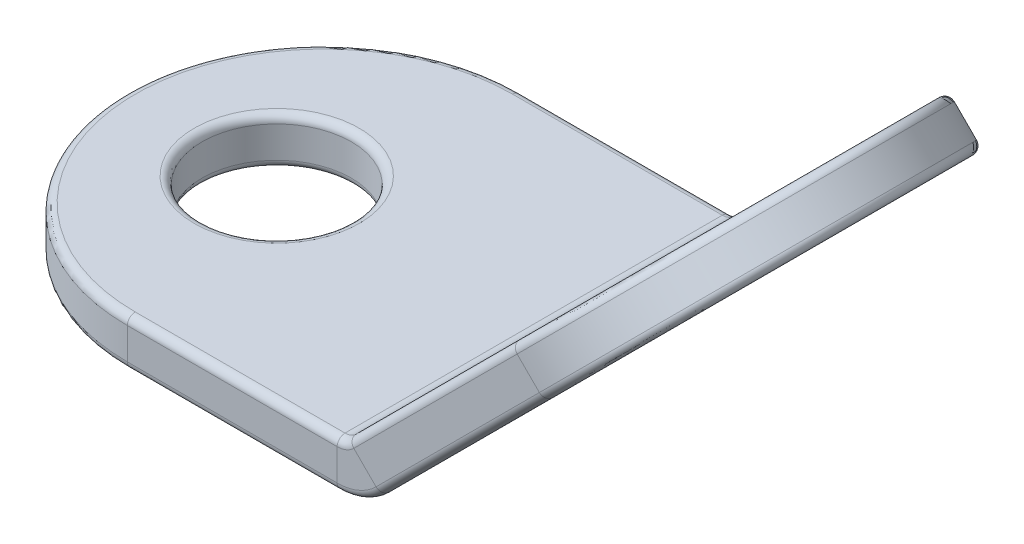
ISO-10303-21;
HEADER;
FILE_DESCRIPTION(('STEP AP214'),'2;1');
FILE_NAME('part.step','',(''),(''),'','','');
FILE_SCHEMA(('AUTOMOTIVE_DESIGN { 1 0 10303 214 1 1 1 1 }'));
ENDSEC;
DATA;
#1=APPLICATION_CONTEXT('core data for automotive mechanical design processes');
#2=APPLICATION_PROTOCOL_DEFINITION('international standard','automotive_design',2000,#1);
#3=PRODUCT_CONTEXT('',#1,'mechanical');
#4=PRODUCT('Part','Part','',(#3));
#5=PRODUCT_RELATED_PRODUCT_CATEGORY('part','',(#4));
#6=PRODUCT_DEFINITION_FORMATION('','',#4);
#7=PRODUCT_DEFINITION_CONTEXT('part definition',#1,'design');
#8=PRODUCT_DEFINITION('design','',#6,#7);
#9=PRODUCT_DEFINITION_SHAPE('','',#8);
#10=(LENGTH_UNIT() NAMED_UNIT(*) SI_UNIT(.MILLI.,.METRE.));
#11=(NAMED_UNIT(*) PLANE_ANGLE_UNIT() SI_UNIT($,.RADIAN.));
#12=(NAMED_UNIT(*) SI_UNIT($,.STERADIAN.) SOLID_ANGLE_UNIT());
#13=UNCERTAINTY_MEASURE_WITH_UNIT(LENGTH_MEASURE(1.E-05),#10,'distance_accuracy_value','');
#14=(GEOMETRIC_REPRESENTATION_CONTEXT(3) GLOBAL_UNCERTAINTY_ASSIGNED_CONTEXT((#13)) GLOBAL_UNIT_ASSIGNED_CONTEXT((#10,
#11,#12)) REPRESENTATION_CONTEXT('',''));
#15=CARTESIAN_POINT('',(0.,0.,0.));
#16=DIRECTION('',(0.,0.,1.));
#17=DIRECTION('',(1.,0.,0.));
#18=AXIS2_PLACEMENT_3D('',#15,#16,#17);
#19=CARTESIAN_POINT('',(2.71685670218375,-4.90314329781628,-6.35));
#20=DIRECTION('',(-0.707106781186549,0.707106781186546,0.));
#21=DIRECTION('',(0.,0.,1.));
#22=AXIS2_PLACEMENT_3D('',#19,#20,#21);
#23=PLANE('',#22);
#24=CARTESIAN_POINT('',(14.570794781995,6.95079478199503,-6.35));
#25=DIRECTION('',(-0.707106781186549,0.707106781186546,0.));
#26=DIRECTION('',(-0.707106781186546,-0.707106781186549,0.));
#27=AXIS2_PLACEMENT_3D('',#24,#25,#26);
#28=CIRCLE('',#27,2.667);
#29=CARTESIAN_POINT('',(14.570794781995,6.95079478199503,-3.683));
#30=VERTEX_POINT('',#29);
#31=CARTESIAN_POINT('',(14.570794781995,6.95079478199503,-9.017));
#32=VERTEX_POINT('',#31);
#33=EDGE_CURVE('E256',#30,#32,#28,.T.);
#34=ORIENTED_EDGE('',*,*,#33,.T.);
#35=DIRECTION('',(-0.707106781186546,-0.707106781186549,0.));
#36=VECTOR('',#35,1.);
#37=CARTESIAN_POINT('',(10.5296795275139,2.9096795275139,-9.017));
#38=LINE('',#37,#36);
#39=CARTESIAN_POINT('',(10.5296795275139,2.9096795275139,-9.017));
#40=VERTEX_POINT('',#39);
#41=EDGE_CURVE('E258',#32,#40,#38,.T.);
#42=ORIENTED_EDGE('',*,*,#41,.T.);
#43=CARTESIAN_POINT('',(10.5296795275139,2.9096795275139,-6.35));
#44=DIRECTION('',(-0.707106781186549,0.707106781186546,0.));
#45=DIRECTION('',(-0.707106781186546,-0.707106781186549,0.));
#46=AXIS2_PLACEMENT_3D('',#43,#44,#45);
#47=CIRCLE('',#46,2.667);
#48=CARTESIAN_POINT('',(10.5296795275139,2.9096795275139,-3.683));
#49=VERTEX_POINT('',#48);
#50=EDGE_CURVE('E252',#40,#49,#47,.T.);
#51=ORIENTED_EDGE('',*,*,#50,.T.);
#52=DIRECTION('',(0.707106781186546,0.707106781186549,0.));
#53=VECTOR('',#52,1.);
#54=CARTESIAN_POINT('',(14.570794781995,6.95079478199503,-3.683));
#55=LINE('',#54,#53);
#56=EDGE_CURVE('E254',#49,#30,#55,.T.);
#57=ORIENTED_EDGE('',*,*,#56,.T.);
#58=EDGE_LOOP('',(#34,#42,#51,#57));
#59=FACE_BOUND('',#58,.T.);
#60=DIRECTION('',(0.,0.,-1.));
#61=VECTOR('',#60,1.);
#62=CARTESIAN_POINT('',(8.21515902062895,0.595159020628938,-6.35));
#63=LINE('',#62,#61);
#64=CARTESIAN_POINT('',(8.21515902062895,0.595159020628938,-0.254));
#65=VERTEX_POINT('',#64);
#66=CARTESIAN_POINT('',(8.21515902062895,0.595159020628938,-12.446));
#67=VERTEX_POINT('',#66);
#68=EDGE_CURVE('E358',#65,#67,#63,.T.);
#69=ORIENTED_EDGE('',*,*,#68,.T.);
#70=DIRECTION('',(-0.707106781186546,-0.707106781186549,0.));
#71=VECTOR('',#70,1.);
#72=CARTESIAN_POINT('',(2.71685670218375,-4.90314329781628,-12.446));
#73=LINE('',#72,#71);
#74=CARTESIAN_POINT('',(13.4931640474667,5.87316404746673,-12.446));
#75=VERTEX_POINT('',#74);
#76=EDGE_CURVE('E265',#67,#75,#73,.F.);
#77=ORIENTED_EDGE('',*,*,#76,.T.);
#78=CARTESIAN_POINT('',(13.4931640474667,5.87316404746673,-6.35));
#79=DIRECTION('',(-0.707106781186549,0.707106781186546,0.));
#80=DIRECTION('',(-0.707106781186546,-0.707106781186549,0.));
#81=AXIS2_PLACEMENT_3D('',#78,#79,#80);
#82=CIRCLE('',#81,6.096);
#83=CARTESIAN_POINT('',(13.4931640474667,5.87316404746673,-0.254));
#84=VERTEX_POINT('',#83);
#85=EDGE_CURVE('E263',#75,#84,#82,.F.);
#86=ORIENTED_EDGE('',*,*,#85,.T.);
#87=DIRECTION('',(0.707106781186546,0.707106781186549,0.));
#88=VECTOR('',#87,1.);
#89=CARTESIAN_POINT('',(2.71685670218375,-4.90314329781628,-0.254));
#90=LINE('',#89,#88);
#91=EDGE_CURVE('E261',#84,#65,#90,.F.);
#92=ORIENTED_EDGE('',*,*,#91,.T.);
#93=EDGE_LOOP('',(#69,#77,#86,#92));
#94=FACE_BOUND('',#93,.T.);
#95=ADVANCED_FACE('F44',(#59,#94),#23,.F.);
#96=CARTESIAN_POINT('',(1.63922596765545,-3.82551256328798,0.));
#97=DIRECTION('',(0.,0.,-1.));
#98=DIRECTION('',(-0.707106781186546,-0.707106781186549,0.));
#99=AXIS2_PLACEMENT_3D('',#96,#97,#98);
#100=PLANE('',#99);
#101=DIRECTION('',(0.707106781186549,-0.707106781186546,0.));
#102=VECTOR('',#101,1.);
#103=CARTESIAN_POINT('',(7.13752828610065,1.67278975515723,0.));
#104=LINE('',#103,#102);
#105=CARTESIAN_POINT('',(7.31713340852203,1.49318463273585,0.));
#106=VERTEX_POINT('',#105);
#107=CARTESIAN_POINT('',(8.03555389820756,0.774764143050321,0.));
#108=VERTEX_POINT('',#107);
#109=EDGE_CURVE('E209',#106,#108,#104,.T.);
#110=ORIENTED_EDGE('',*,*,#109,.T.);
#111=DIRECTION('',(0.707106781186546,0.707106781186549,0.));
#112=VECTOR('',#111,1.);
#113=CARTESIAN_POINT('',(2.53725157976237,-4.72353817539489,0.));
#114=LINE('',#113,#112);
#115=CARTESIAN_POINT('',(13.3135589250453,6.05276916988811,0.));
#116=VERTEX_POINT('',#115);
#117=EDGE_CURVE('E273',#108,#116,#114,.T.);
#118=ORIENTED_EDGE('',*,*,#117,.T.);
#119=DIRECTION('',(0.707106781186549,-0.707106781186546,0.));
#120=VECTOR('',#119,1.);
#121=CARTESIAN_POINT('',(12.4155333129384,6.95079478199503,0.));
#122=LINE('',#121,#120);
#123=CARTESIAN_POINT('',(12.5951384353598,6.77118965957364,0.));
#124=VERTEX_POINT('',#123);
#125=EDGE_CURVE('E350',#124,#116,#122,.T.);
#126=ORIENTED_EDGE('',*,*,#125,.F.);
#127=DIRECTION('',(0.707106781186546,0.707106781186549,0.));
#128=VECTOR('',#127,1.);
#129=CARTESIAN_POINT('',(7.31713340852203,1.49318463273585,0.));
#130=LINE('',#129,#128);
#131=EDGE_CURVE('E271',#124,#106,#130,.F.);
#132=ORIENTED_EDGE('',*,*,#131,.T.);
#133=EDGE_LOOP('',(#110,#118,#126,#132));
#134=FACE_BOUND('',#133,.T.);
#135=ADVANCED_FACE('F46',(#134),#100,.F.);
#136=CARTESIAN_POINT('',(1.63922596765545,-3.82551256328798,-12.7));
#137=DIRECTION('',(0.,0.,1.));
#138=DIRECTION('',(0.707106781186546,0.707106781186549,0.));
#139=AXIS2_PLACEMENT_3D('',#136,#137,#138);
#140=PLANE('',#139);
#141=DIRECTION('',(0.707106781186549,-0.707106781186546,0.));
#142=VECTOR('',#141,1.);
#143=CARTESIAN_POINT('',(12.4155333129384,6.95079478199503,-12.7));
#144=LINE('',#143,#142);
#145=CARTESIAN_POINT('',(12.5951384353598,6.77118965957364,-12.7));
#146=VERTEX_POINT('',#145);
#147=CARTESIAN_POINT('',(13.3135589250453,6.05276916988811,-12.7));
#148=VERTEX_POINT('',#147);
#149=EDGE_CURVE('E347',#146,#148,#144,.T.);
#150=ORIENTED_EDGE('',*,*,#149,.T.);
#151=DIRECTION('',(-0.707106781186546,-0.707106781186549,0.));
#152=VECTOR('',#151,1.);
#153=CARTESIAN_POINT('',(2.53725157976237,-4.72353817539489,-12.7));
#154=LINE('',#153,#152);
#155=CARTESIAN_POINT('',(8.03555389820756,0.774764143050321,-12.7));
#156=VERTEX_POINT('',#155);
#157=EDGE_CURVE('E269',#148,#156,#154,.T.);
#158=ORIENTED_EDGE('',*,*,#157,.T.);
#159=DIRECTION('',(-0.707106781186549,0.707106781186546,0.));
#160=VECTOR('',#159,1.);
#161=CARTESIAN_POINT('',(7.13752828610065,1.67278975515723,-12.7));
#162=LINE('',#161,#160);
#163=CARTESIAN_POINT('',(7.31713340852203,1.49318463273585,-12.7));
#164=VERTEX_POINT('',#163);
#165=EDGE_CURVE('E355',#156,#164,#162,.T.);
#166=ORIENTED_EDGE('',*,*,#165,.T.);
#167=DIRECTION('',(-0.707106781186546,-0.707106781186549,0.));
#168=VECTOR('',#167,1.);
#169=CARTESIAN_POINT('',(12.5951384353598,6.77118965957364,-12.7));
#170=LINE('',#169,#168);
#171=EDGE_CURVE('E267',#164,#146,#170,.F.);
#172=ORIENTED_EDGE('',*,*,#171,.T.);
#173=EDGE_LOOP('',(#150,#158,#166,#172));
#174=FACE_BOUND('',#173,.T.);
#175=ADVANCED_FACE('F501',(#174),#140,.F.);
#176=CARTESIAN_POINT('',(1.63922596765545,-3.82551256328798,-6.35));
#177=DIRECTION('',(-0.707106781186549,0.707106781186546,0.));
#178=DIRECTION('',(0.,0.,1.));
#179=AXIS2_PLACEMENT_3D('',#176,#177,#178);
#180=PLANE('',#179);
#181=DIRECTION('',(-0.707106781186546,-0.707106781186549,0.));
#182=VECTOR('',#181,1.);
#183=CARTESIAN_POINT('',(1.63922596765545,-3.82551256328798,-9.017));
#184=LINE('',#183,#182);
#185=CARTESIAN_POINT('',(9.4520487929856,3.9873102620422,-9.017));
#186=VERTEX_POINT('',#185);
#187=CARTESIAN_POINT('',(13.4931640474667,8.02842551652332,-9.017));
#188=VERTEX_POINT('',#187);
#189=EDGE_CURVE('E303',#186,#188,#184,.F.);
#190=ORIENTED_EDGE('',*,*,#189,.T.);
#191=CARTESIAN_POINT('',(13.4931640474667,8.02842551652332,-6.35));
#192=DIRECTION('',(-0.707106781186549,0.707106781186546,0.));
#193=DIRECTION('',(-0.707106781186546,-0.707106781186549,0.));
#194=AXIS2_PLACEMENT_3D('',#191,#192,#193);
#195=CIRCLE('',#194,2.667);
#196=CARTESIAN_POINT('',(13.4931640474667,8.02842551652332,-3.683));
#197=VERTEX_POINT('',#196);
#198=EDGE_CURVE('E305',#188,#197,#195,.F.);
#199=ORIENTED_EDGE('',*,*,#198,.T.);
#200=DIRECTION('',(0.707106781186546,0.707106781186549,0.));
#201=VECTOR('',#200,1.);
#202=CARTESIAN_POINT('',(1.63922596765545,-3.82551256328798,-3.683));
#203=LINE('',#202,#201);
#204=CARTESIAN_POINT('',(9.4520487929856,3.9873102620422,-3.683));
#205=VERTEX_POINT('',#204);
#206=EDGE_CURVE('E299',#197,#205,#203,.F.);
#207=ORIENTED_EDGE('',*,*,#206,.T.);
#208=CARTESIAN_POINT('',(9.4520487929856,3.9873102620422,-6.35));
#209=DIRECTION('',(-0.707106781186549,0.707106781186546,0.));
#210=DIRECTION('',(-0.707106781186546,-0.707106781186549,0.));
#211=AXIS2_PLACEMENT_3D('',#208,#209,#210);
#212=CIRCLE('',#211,2.667);
#213=EDGE_CURVE('E301',#205,#186,#212,.F.);
#214=ORIENTED_EDGE('',*,*,#213,.T.);
#215=EDGE_LOOP('',(#190,#199,#207,#214));
#216=FACE_BOUND('',#215,.T.);
#217=CARTESIAN_POINT('',(12.4155333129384,6.95079478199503,-6.35));
#218=DIRECTION('',(-0.707106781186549,0.707106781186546,0.));
#219=DIRECTION('',(-0.707106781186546,-0.707106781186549,0.));
#220=AXIS2_PLACEMENT_3D('',#217,#218,#219);
#221=CIRCLE('',#220,6.096);
#222=CARTESIAN_POINT('',(12.4155333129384,6.95079478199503,-0.254));
#223=VERTEX_POINT('',#222);
#224=CARTESIAN_POINT('',(12.4155333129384,6.95079478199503,-12.446));
#225=VERTEX_POINT('',#224);
#226=EDGE_CURVE('E295',#223,#225,#221,.T.);
#227=ORIENTED_EDGE('',*,*,#226,.T.);
#228=DIRECTION('',(-0.707106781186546,-0.707106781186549,0.));
#229=VECTOR('',#228,1.);
#230=CARTESIAN_POINT('',(7.13752828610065,1.67278975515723,-12.446));
#231=LINE('',#230,#229);
#232=CARTESIAN_POINT('',(7.13752828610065,1.67278975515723,-12.446));
#233=VERTEX_POINT('',#232);
#234=EDGE_CURVE('E297',#225,#233,#231,.T.);
#235=ORIENTED_EDGE('',*,*,#234,.T.);
#236=DIRECTION('',(0.,0.,-1.));
#237=VECTOR('',#236,1.);
#238=CARTESIAN_POINT('',(7.13752828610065,1.67278975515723,-6.35));
#239=LINE('',#238,#237);
#240=CARTESIAN_POINT('',(7.13752828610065,1.67278975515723,-0.254));
#241=VERTEX_POINT('',#240);
#242=EDGE_CURVE('E353',#241,#233,#239,.T.);
#243=ORIENTED_EDGE('',*,*,#242,.F.);
#244=DIRECTION('',(0.707106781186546,0.707106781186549,0.));
#245=VECTOR('',#244,1.);
#246=CARTESIAN_POINT('',(12.4155333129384,6.95079478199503,-0.254));
#247=LINE('',#246,#245);
#248=EDGE_CURVE('E293',#241,#223,#247,.T.);
#249=ORIENTED_EDGE('',*,*,#248,.T.);
#250=EDGE_LOOP('',(#227,#235,#243,#249));
#251=FACE_BOUND('',#250,.T.);
#252=ADVANCED_FACE('F506',(#216,#251),#180,.T.);
#253=CARTESIAN_POINT('',(12.4155333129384,6.95079478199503,-6.35));
#254=DIRECTION('',(0.707106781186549,-0.707106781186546,0.));
#255=DIRECTION('',(0.,0.,-1.));
#256=AXIS2_PLACEMENT_3D('',#253,#254,#255);
#257=CYLINDRICAL_SURFACE('',#256,6.35);
#258=ORIENTED_EDGE('',*,*,#125,.T.);
#259=CARTESIAN_POINT('',(13.3135589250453,6.05276916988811,-6.35));
#260=DIRECTION('',(-0.707106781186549,0.707106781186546,0.));
#261=DIRECTION('',(-0.707106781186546,-0.707106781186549,0.));
#262=AXIS2_PLACEMENT_3D('',#259,#260,#261);
#263=CIRCLE('',#262,6.35);
#264=EDGE_CURVE('E250',#116,#148,#263,.T.);
#265=ORIENTED_EDGE('',*,*,#264,.T.);
#266=ORIENTED_EDGE('',*,*,#149,.F.);
#267=CARTESIAN_POINT('',(12.5951384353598,6.77118965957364,-6.35));
#268=DIRECTION('',(-0.707106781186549,0.707106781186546,0.));
#269=DIRECTION('',(-0.707106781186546,-0.707106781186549,0.));
#270=AXIS2_PLACEMENT_3D('',#267,#268,#269);
#271=CIRCLE('',#270,6.35);
#272=EDGE_CURVE('E243',#146,#124,#271,.F.);
#273=ORIENTED_EDGE('',*,*,#272,.T.);
#274=EDGE_LOOP('',(#258,#265,#266,#273));
#275=FACE_BOUND('',#274,.T.);
#276=ADVANCED_FACE('F510',(#275),#257,.T.);
#277=CARTESIAN_POINT('',(9.4520487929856,3.9873102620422,-6.35));
#278=DIRECTION('',(0.707106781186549,-0.707106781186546,0.));
#279=DIRECTION('',(0.,0.,-1.));
#280=AXIS2_PLACEMENT_3D('',#277,#278,#279);
#281=CYLINDRICAL_SURFACE('',#280,2.413);
#282=DIRECTION('',(0.707106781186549,-0.707106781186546,0.));
#283=VECTOR('',#282,1.);
#284=CARTESIAN_POINT('',(9.4520487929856,3.9873102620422,-3.937));
#285=LINE('',#284,#283);
#286=CARTESIAN_POINT('',(9.63165391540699,3.80770513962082,-3.937));
#287=VERTEX_POINT('',#286);
#288=CARTESIAN_POINT('',(10.3500744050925,3.08928464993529,-3.937));
#289=VERTEX_POINT('',#288);
#290=EDGE_CURVE('E344',#287,#289,#285,.T.);
#291=ORIENTED_EDGE('',*,*,#290,.T.);
#292=CARTESIAN_POINT('',(10.3500744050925,3.08928464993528,-6.35));
#293=DIRECTION('',(-0.707106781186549,0.707106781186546,0.));
#294=DIRECTION('',(-0.707106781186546,-0.707106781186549,0.));
#295=AXIS2_PLACEMENT_3D('',#292,#293,#294);
#296=CIRCLE('',#295,2.413);
#297=CARTESIAN_POINT('',(10.3500744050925,3.08928464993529,-8.763));
#298=VERTEX_POINT('',#297);
#299=EDGE_CURVE('E291',#289,#298,#296,.F.);
#300=ORIENTED_EDGE('',*,*,#299,.T.);
#301=DIRECTION('',(0.707106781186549,-0.707106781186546,0.));
#302=VECTOR('',#301,1.);
#303=CARTESIAN_POINT('',(9.4520487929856,3.9873102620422,-8.763));
#304=LINE('',#303,#302);
#305=CARTESIAN_POINT('',(9.63165391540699,3.80770513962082,-8.763));
#306=VERTEX_POINT('',#305);
#307=EDGE_CURVE('E325',#306,#298,#304,.T.);
#308=ORIENTED_EDGE('',*,*,#307,.F.);
#309=CARTESIAN_POINT('',(9.63165391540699,3.80770513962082,-6.35));
#310=DIRECTION('',(-0.707106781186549,0.707106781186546,0.));
#311=DIRECTION('',(-0.707106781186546,-0.707106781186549,0.));
#312=AXIS2_PLACEMENT_3D('',#309,#310,#311);
#313=CIRCLE('',#312,2.413);
#314=EDGE_CURVE('E289',#306,#287,#313,.T.);
#315=ORIENTED_EDGE('',*,*,#314,.T.);
#316=EDGE_LOOP('',(#291,#300,#308,#315));
#317=FACE_BOUND('',#316,.T.);
#318=ADVANCED_FACE('F514',(#317),#281,.F.);
#319=CARTESIAN_POINT('',(9.4520487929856,3.9873102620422,-3.937));
#320=DIRECTION('',(0.,0.,-1.));
#321=DIRECTION('',(-0.707106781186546,-0.707106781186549,0.));
#322=AXIS2_PLACEMENT_3D('',#319,#320,#321);
#323=PLANE('',#322);
#324=DIRECTION('',(0.707106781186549,-0.707106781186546,0.));
#325=VECTOR('',#324,1.);
#326=CARTESIAN_POINT('',(13.4931640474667,8.02842551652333,-3.937));
#327=LINE('',#326,#325);
#328=CARTESIAN_POINT('',(13.6727691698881,7.84882039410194,-3.937));
#329=VERTEX_POINT('',#328);
#330=CARTESIAN_POINT('',(14.3911896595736,7.13039990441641,-3.937));
#331=VERTEX_POINT('',#330);
#332=EDGE_CURVE('E341',#329,#331,#327,.T.);
#333=ORIENTED_EDGE('',*,*,#332,.T.);
#334=DIRECTION('',(0.707106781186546,0.707106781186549,0.));
#335=VECTOR('',#334,1.);
#336=CARTESIAN_POINT('',(10.3500744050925,3.08928464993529,-3.937));
#337=LINE('',#336,#335);
#338=EDGE_CURVE('E287',#331,#289,#337,.F.);
#339=ORIENTED_EDGE('',*,*,#338,.T.);
#340=ORIENTED_EDGE('',*,*,#290,.F.);
#341=DIRECTION('',(0.707106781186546,0.707106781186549,0.));
#342=VECTOR('',#341,1.);
#343=CARTESIAN_POINT('',(9.63165391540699,3.80770513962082,-3.937));
#344=LINE('',#343,#342);
#345=EDGE_CURVE('E285',#287,#329,#344,.T.);
#346=ORIENTED_EDGE('',*,*,#345,.T.);
#347=EDGE_LOOP('',(#333,#339,#340,#346));
#348=FACE_BOUND('',#347,.T.);
#349=ADVANCED_FACE('F518',(#348),#323,.T.);
#350=CARTESIAN_POINT('',(13.4931640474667,8.02842551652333,-6.35));
#351=DIRECTION('',(0.707106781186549,-0.707106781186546,0.));
#352=DIRECTION('',(0.,0.,-1.));
#353=AXIS2_PLACEMENT_3D('',#350,#351,#352);
#354=CYLINDRICAL_SURFACE('',#353,2.413);
#355=DIRECTION('',(0.707106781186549,-0.707106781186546,0.));
#356=VECTOR('',#355,1.);
#357=CARTESIAN_POINT('',(13.4931640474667,8.02842551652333,-8.763));
#358=LINE('',#357,#356);
#359=CARTESIAN_POINT('',(13.6727691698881,7.84882039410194,-8.763));
#360=VERTEX_POINT('',#359);
#361=CARTESIAN_POINT('',(14.3911896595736,7.13039990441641,-8.763));
#362=VERTEX_POINT('',#361);
#363=EDGE_CURVE('E338',#360,#362,#358,.T.);
#364=ORIENTED_EDGE('',*,*,#363,.T.);
#365=CARTESIAN_POINT('',(14.3911896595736,7.13039990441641,-6.35));
#366=DIRECTION('',(-0.707106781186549,0.707106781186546,0.));
#367=DIRECTION('',(-0.707106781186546,-0.707106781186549,0.));
#368=AXIS2_PLACEMENT_3D('',#365,#366,#367);
#369=CIRCLE('',#368,2.413);
#370=EDGE_CURVE('E283',#362,#331,#369,.F.);
#371=ORIENTED_EDGE('',*,*,#370,.T.);
#372=ORIENTED_EDGE('',*,*,#332,.F.);
#373=CARTESIAN_POINT('',(13.6727691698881,7.84882039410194,-6.35));
#374=DIRECTION('',(-0.707106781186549,0.707106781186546,0.));
#375=DIRECTION('',(-0.707106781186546,-0.707106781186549,0.));
#376=AXIS2_PLACEMENT_3D('',#373,#374,#375);
#377=CIRCLE('',#376,2.413);
#378=EDGE_CURVE('E280',#329,#360,#377,.T.);
#379=ORIENTED_EDGE('',*,*,#378,.T.);
#380=EDGE_LOOP('',(#364,#371,#372,#379));
#381=FACE_BOUND('',#380,.T.);
#382=ADVANCED_FACE('F522',(#381),#354,.F.);
#383=CARTESIAN_POINT('',(9.4520487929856,3.9873102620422,-8.763));
#384=DIRECTION('',(0.,0.,1.));
#385=DIRECTION('',(0.707106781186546,0.707106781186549,0.));
#386=AXIS2_PLACEMENT_3D('',#383,#384,#385);
#387=PLANE('',#386);
#388=ORIENTED_EDGE('',*,*,#307,.T.);
#389=DIRECTION('',(-0.707106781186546,-0.707106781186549,0.));
#390=VECTOR('',#389,1.);
#391=CARTESIAN_POINT('',(14.3911896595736,7.13039990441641,-8.763));
#392=LINE('',#391,#390);
#393=EDGE_CURVE('E277',#298,#362,#392,.F.);
#394=ORIENTED_EDGE('',*,*,#393,.T.);
#395=ORIENTED_EDGE('',*,*,#363,.F.);
#396=DIRECTION('',(-0.707106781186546,-0.707106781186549,0.));
#397=VECTOR('',#396,1.);
#398=CARTESIAN_POINT('',(9.63165391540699,3.80770513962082,-8.763));
#399=LINE('',#398,#397);
#400=EDGE_CURVE('E275',#360,#306,#399,.T.);
#401=ORIENTED_EDGE('',*,*,#400,.T.);
#402=EDGE_LOOP('',(#388,#394,#395,#401));
#403=FACE_BOUND('',#402,.T.);
#404=ADVANCED_FACE('F526',(#403),#387,.T.);
#405=CARTESIAN_POINT('',(0.,1.524,-6.35));
#406=DIRECTION('',(0.,-1.,0.));
#407=DIRECTION('',(0.,0.,-1.));
#408=AXIS2_PLACEMENT_3D('',#405,#406,#407);
#409=CYLINDRICAL_SURFACE('',#408,6.35);
#410=DIRECTION('',(0.,-1.,0.));
#411=VECTOR('',#410,1.);
#412=CARTESIAN_POINT('',(0.,1.524,-12.7));
#413=LINE('',#412,#411);
#414=CARTESIAN_POINT('',(0.,1.27,-12.7));
#415=VERTEX_POINT('',#414);
#416=CARTESIAN_POINT('',(0.,0.254000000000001,-12.7));
#417=VERTEX_POINT('',#416);
#418=EDGE_CURVE('E323',#415,#417,#413,.T.);
#419=ORIENTED_EDGE('',*,*,#418,.T.);
#420=CARTESIAN_POINT('',(0.,0.254,-6.35));
#421=DIRECTION('',(0.,1.,0.));
#422=DIRECTION('',(0.,0.,1.));
#423=AXIS2_PLACEMENT_3D('',#420,#421,#422);
#424=CIRCLE('',#423,6.35);
#425=CARTESIAN_POINT('',(0.,0.254000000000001,0.));
#426=VERTEX_POINT('',#425);
#427=EDGE_CURVE('E241',#417,#426,#424,.T.);
#428=ORIENTED_EDGE('',*,*,#427,.T.);
#429=DIRECTION('',(0.,-1.,0.));
#430=VECTOR('',#429,1.);
#431=CARTESIAN_POINT('',(0.,1.524,0.));
#432=LINE('',#431,#430);
#433=CARTESIAN_POINT('',(0.,1.27,0.));
#434=VERTEX_POINT('',#433);
#435=EDGE_CURVE('E322',#434,#426,#432,.T.);
#436=ORIENTED_EDGE('',*,*,#435,.F.);
#437=CARTESIAN_POINT('',(0.,1.27,-6.35));
#438=DIRECTION('',(0.,1.,0.));
#439=DIRECTION('',(0.,0.,1.));
#440=AXIS2_PLACEMENT_3D('',#437,#438,#439);
#441=CIRCLE('',#440,6.35);
#442=EDGE_CURVE('E245',#434,#415,#441,.F.);
#443=ORIENTED_EDGE('',*,*,#442,.T.);
#444=EDGE_LOOP('',(#419,#428,#436,#443));
#445=FACE_BOUND('',#444,.T.);
#446=ADVANCED_FACE('F395',(#445),#409,.T.);
#447=CARTESIAN_POINT('',(-1.524,1.524,-6.35));
#448=DIRECTION('',(0.,-1.,0.));
#449=DIRECTION('',(0.,0.,-1.));
#450=AXIS2_PLACEMENT_3D('',#447,#448,#449);
#451=CYLINDRICAL_SURFACE('',#450,2.413);
#452=CARTESIAN_POINT('',(-1.524,0.254,-6.35));
#453=DIRECTION('',(0.,1.,0.));
#454=DIRECTION('',(0.,0.,1.));
#455=AXIS2_PLACEMENT_3D('',#452,#453,#454);
#456=CIRCLE('',#455,2.413);
#457=CARTESIAN_POINT('',(-1.524,0.254,-8.763));
#458=VERTEX_POINT('',#457);
#459=EDGE_CURVE('E387',#458,#458,#456,.F.);
#460=CARTESIAN_POINT('',(-1.524,1.27,-6.35));
#461=DIRECTION('',(0.,1.,0.));
#462=DIRECTION('',(0.,0.,1.));
#463=AXIS2_PLACEMENT_3D('',#460,#461,#462);
#464=CIRCLE('',#463,2.413);
#465=CARTESIAN_POINT('',(-1.524,1.27,-8.763));
#466=VERTEX_POINT('',#465);
#467=EDGE_CURVE('E384',#466,#466,#464,.T.);
#468=CARTESIAN_POINT('',(-1.524,0.254,-8.763));
#469=CARTESIAN_POINT('',(-1.524,0.264583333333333,-8.763));
#470=CARTESIAN_POINT('',(-1.524,0.275166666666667,-8.763));
#471=CARTESIAN_POINT('',(-1.524,0.296333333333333,-8.763));
#472=CARTESIAN_POINT('',(-1.524,0.306916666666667,-8.763));
#473=CARTESIAN_POINT('',(-1.524,0.328083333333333,-8.763));
#474=CARTESIAN_POINT('',(-1.524,0.338666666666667,-8.763));
#475=CARTESIAN_POINT('',(-1.524,0.359833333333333,-8.763));
#476=CARTESIAN_POINT('',(-1.524,0.370416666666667,-8.763));
#477=CARTESIAN_POINT('',(-1.524,0.391583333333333,-8.763));
#478=CARTESIAN_POINT('',(-1.524,0.402166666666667,-8.763));
#479=CARTESIAN_POINT('',(-1.524,0.423333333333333,-8.763));
#480=CARTESIAN_POINT('',(-1.524,0.433916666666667,-8.763));
#481=CARTESIAN_POINT('',(-1.524,0.455083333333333,-8.763));
#482=CARTESIAN_POINT('',(-1.524,0.465666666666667,-8.763));
#483=CARTESIAN_POINT('',(-1.524,0.486833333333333,-8.763));
#484=CARTESIAN_POINT('',(-1.524,0.497416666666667,-8.763));
#485=CARTESIAN_POINT('',(-1.524,0.518583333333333,-8.763));
#486=CARTESIAN_POINT('',(-1.524,0.529166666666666,-8.763));
#487=CARTESIAN_POINT('',(-1.524,0.550333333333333,-8.763));
#488=CARTESIAN_POINT('',(-1.524,0.560916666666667,-8.763));
#489=CARTESIAN_POINT('',(-1.524,0.582083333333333,-8.763));
#490=CARTESIAN_POINT('',(-1.524,0.592666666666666,-8.763));
#491=CARTESIAN_POINT('',(-1.524,0.613833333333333,-8.763));
#492=CARTESIAN_POINT('',(-1.524,0.624416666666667,-8.763));
#493=CARTESIAN_POINT('',(-1.524,0.645583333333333,-8.763));
#494=CARTESIAN_POINT('',(-1.524,0.656166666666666,-8.763));
#495=CARTESIAN_POINT('',(-1.524,0.677333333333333,-8.763));
#496=CARTESIAN_POINT('',(-1.524,0.687916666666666,-8.763));
#497=CARTESIAN_POINT('',(-1.524,0.709083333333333,-8.763));
#498=CARTESIAN_POINT('',(-1.524,0.719666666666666,-8.763));
#499=CARTESIAN_POINT('',(-1.524,0.740833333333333,-8.763));
#500=CARTESIAN_POINT('',(-1.524,0.751416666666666,-8.763));
#501=CARTESIAN_POINT('',(-1.524,0.772583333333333,-8.763));
#502=CARTESIAN_POINT('',(-1.524,0.783166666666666,-8.763));
#503=CARTESIAN_POINT('',(-1.524,0.804333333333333,-8.763));
#504=CARTESIAN_POINT('',(-1.524,0.814916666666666,-8.763));
#505=CARTESIAN_POINT('',(-1.524,0.836083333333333,-8.763));
#506=CARTESIAN_POINT('',(-1.524,0.846666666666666,-8.763));
#507=CARTESIAN_POINT('',(-1.524,0.867833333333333,-8.763));
#508=CARTESIAN_POINT('',(-1.524,0.878416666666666,-8.763));
#509=CARTESIAN_POINT('',(-1.524,0.899583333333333,-8.763));
#510=CARTESIAN_POINT('',(-1.524,0.910166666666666,-8.763));
#511=CARTESIAN_POINT('',(-1.524,0.931333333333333,-8.763));
#512=CARTESIAN_POINT('',(-1.524,0.941916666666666,-8.763));
#513=CARTESIAN_POINT('',(-1.524,0.963083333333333,-8.763));
#514=CARTESIAN_POINT('',(-1.524,0.973666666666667,-8.763));
#515=CARTESIAN_POINT('',(-1.524,0.994833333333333,-8.763));
#516=CARTESIAN_POINT('',(-1.524,1.00541666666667,-8.763));
#517=CARTESIAN_POINT('',(-1.524,1.02658333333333,-8.763));
#518=CARTESIAN_POINT('',(-1.524,1.03716666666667,-8.763));
#519=CARTESIAN_POINT('',(-1.524,1.05833333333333,-8.763));
#520=CARTESIAN_POINT('',(-1.524,1.06891666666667,-8.763));
#521=CARTESIAN_POINT('',(-1.524,1.09008333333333,-8.763));
#522=CARTESIAN_POINT('',(-1.524,1.10066666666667,-8.763));
#523=CARTESIAN_POINT('',(-1.524,1.12183333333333,-8.763));
#524=CARTESIAN_POINT('',(-1.524,1.13241666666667,-8.763));
#525=CARTESIAN_POINT('',(-1.524,1.15358333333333,-8.763));
#526=CARTESIAN_POINT('',(-1.524,1.16416666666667,-8.763));
#527=CARTESIAN_POINT('',(-1.524,1.18533333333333,-8.763));
#528=CARTESIAN_POINT('',(-1.524,1.19591666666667,-8.763));
#529=CARTESIAN_POINT('',(-1.524,1.21708333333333,-8.763));
#530=CARTESIAN_POINT('',(-1.524,1.22766666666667,-8.763));
#531=CARTESIAN_POINT('',(-1.524,1.24883333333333,-8.763));
#532=CARTESIAN_POINT('',(-1.524,1.25941666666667,-8.763));
#533=CARTESIAN_POINT('',(-1.524,1.27,-8.763));
#534=B_SPLINE_CURVE_WITH_KNOTS('',3,(#468,#469,#470,#471,#472,#473,#474,#475,#476,#477,#478,
#479,#480,#481,#482,#483,#484,#485,#486,#487,#488,#489,#490,#491,#492,#493,#494,#495,#496,#497,
#498,#499,#500,#501,#502,#503,#504,#505,#506,#507,#508,#509,#510,#511,#512,#513,#514,#515,#516,
#517,#518,#519,#520,#521,#522,#523,#524,#525,#526,#527,#528,#529,#530,#531,#532,#533),
.UNSPECIFIED.,.F.,.F.,(4,2,2,2,2,2,2,2,2,2,2,2,2,2,2,2,2,2,2,2,2,2,2,2,2,2,2,2,2,2,2,2,4),(0.,
0.0317500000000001,0.0635,0.0952500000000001,0.127,0.15875,0.1905,0.22225,0.254,0.28575,0.3175,
0.34925,0.381,0.41275,0.4445,0.47625,0.508,0.53975,0.5715,0.60325,0.635,0.66675,0.6985,0.73025,
0.762,0.79375,0.8255,0.85725,0.889,0.92075,0.9525,0.98425,1.016),.UNSPECIFIED.);
#535=EDGE_CURVE('BSEAM540',#458,#466,#534,.T.);
#536=ORIENTED_EDGE('',*,*,#459,.T.);
#537=ORIENTED_EDGE('',*,*,#467,.T.);
#538=ORIENTED_EDGE('',*,*,#535,.T.);
#539=ORIENTED_EDGE('',*,*,#535,.F.);
#540=EDGE_LOOP('',(#536,#538,#537,#539));
#541=FACE_BOUND('',#540,.T.);
#542=ADVANCED_FACE('F540',(#541),#451,.F.);
#543=CARTESIAN_POINT('',(0.,1.524,-6.35));
#544=DIRECTION('',(0.,1.,0.));
#545=DIRECTION('',(0.,0.,1.));
#546=AXIS2_PLACEMENT_3D('',#543,#544,#545);
#547=PLANE('',#546);
#548=CARTESIAN_POINT('',(-1.524,1.524,-6.35));
#549=DIRECTION('',(0.,1.,0.));
#550=DIRECTION('',(0.,0.,1.));
#551=AXIS2_PLACEMENT_3D('',#548,#549,#550);
#552=CIRCLE('',#551,2.667);
#553=CARTESIAN_POINT('',(-1.524,1.524,-3.683));
#554=VERTEX_POINT('',#553);
#555=EDGE_CURVE('E308',#554,#554,#552,.F.);
#556=ORIENTED_EDGE('',*,*,#555,.T.);
#557=EDGE_LOOP('',(#556));
#558=FACE_BOUND('',#557,.T.);
#559=DIRECTION('',(0.,0.,-1.));
#560=VECTOR('',#559,1.);
#561=CARTESIAN_POINT('',(6.77831804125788,1.524,-6.35));
#562=LINE('',#561,#560);
#563=CARTESIAN_POINT('',(6.77831804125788,1.524,-0.254));
#564=VERTEX_POINT('',#563);
#565=CARTESIAN_POINT('',(6.77831804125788,1.524,-12.446));
#566=VERTEX_POINT('',#565);
#567=EDGE_CURVE('E314',#564,#566,#562,.T.);
#568=ORIENTED_EDGE('',*,*,#567,.T.);
#569=DIRECTION('',(-1.,0.,0.));
#570=VECTOR('',#569,1.);
#571=CARTESIAN_POINT('',(0.,1.524,-12.446));
#572=LINE('',#571,#570);
#573=CARTESIAN_POINT('',(0.,1.524,-12.446));
#574=VERTEX_POINT('',#573);
#575=EDGE_CURVE('E12',#566,#574,#572,.T.);
#576=ORIENTED_EDGE('',*,*,#575,.T.);
#577=CARTESIAN_POINT('',(0.,1.524,-6.35));
#578=DIRECTION('',(0.,1.,0.));
#579=DIRECTION('',(0.,0.,1.));
#580=AXIS2_PLACEMENT_3D('',#577,#578,#579);
#581=CIRCLE('',#580,6.096);
#582=CARTESIAN_POINT('',(0.,1.524,-0.254));
#583=VERTEX_POINT('',#582);
#584=EDGE_CURVE('E52',#574,#583,#581,.T.);
#585=ORIENTED_EDGE('',*,*,#584,.T.);
#586=DIRECTION('',(1.,0.,0.));
#587=VECTOR('',#586,1.);
#588=CARTESIAN_POINT('',(6.77831804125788,1.524,-0.254));
#589=LINE('',#588,#587);
#590=EDGE_CURVE('E311',#583,#564,#589,.T.);
#591=ORIENTED_EDGE('',*,*,#590,.T.);
#592=EDGE_LOOP('',(#568,#576,#585,#591));
#593=FACE_BOUND('',#592,.T.);
#594=ADVANCED_FACE('F313',(#558,#593),#547,.T.);
#595=CARTESIAN_POINT('',(0.,1.524,-12.7));
#596=DIRECTION('',(0.,0.,1.));
#597=DIRECTION('',(1.,0.,0.));
#598=AXIS2_PLACEMENT_3D('',#595,#596,#597);
#599=PLANE('',#598);
#600=DIRECTION('',(0.,1.,0.));
#601=VECTOR('',#600,1.);
#602=CARTESIAN_POINT('',(6.77831804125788,1.524,-12.7));
#603=LINE('',#602,#601);
#604=CARTESIAN_POINT('',(6.77831804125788,0.254,-12.7));
#605=VERTEX_POINT('',#604);
#606=CARTESIAN_POINT('',(6.77831804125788,1.27,-12.7));
#607=VERTEX_POINT('',#606);
#608=EDGE_CURVE('E328',#605,#607,#603,.T.);
#609=ORIENTED_EDGE('',*,*,#608,.F.);
#610=DIRECTION('',(-1.,0.,0.));
#611=VECTOR('',#610,1.);
#612=CARTESIAN_POINT('',(0.,0.254,-12.7));
#613=LINE('',#612,#611);
#614=EDGE_CURVE('E392',#605,#417,#613,.T.);
#615=ORIENTED_EDGE('',*,*,#614,.T.);
#616=ORIENTED_EDGE('',*,*,#418,.F.);
#617=DIRECTION('',(-1.,0.,0.));
#618=VECTOR('',#617,1.);
#619=CARTESIAN_POINT('',(6.77831804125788,1.27,-12.7));
#620=LINE('',#619,#618);
#621=EDGE_CURVE('E390',#415,#607,#620,.F.);
#622=ORIENTED_EDGE('',*,*,#621,.T.);
#623=EDGE_LOOP('',(#609,#615,#616,#622));
#624=FACE_BOUND('',#623,.T.);
#625=ADVANCED_FACE('F401',(#624),#599,.F.);
#626=CARTESIAN_POINT('',(0.,0.,-6.35));
#627=DIRECTION('',(0.,1.,0.));
#628=DIRECTION('',(0.,0.,1.));
#629=AXIS2_PLACEMENT_3D('',#626,#627,#628);
#630=PLANE('',#629);
#631=CARTESIAN_POINT('',(-1.524,0.,-6.35));
#632=DIRECTION('',(0.,1.,0.));
#633=DIRECTION('',(0.,0.,1.));
#634=AXIS2_PLACEMENT_3D('',#631,#632,#633);
#635=CIRCLE('',#634,2.667);
#636=CARTESIAN_POINT('',(-1.524,0.,-3.683));
#637=VERTEX_POINT('',#636);
#638=EDGE_CURVE('E381',#637,#637,#635,.T.);
#639=ORIENTED_EDGE('',*,*,#638,.T.);
#640=EDGE_LOOP('',(#639));
#641=FACE_BOUND('',#640,.T.);
#642=CARTESIAN_POINT('',(0.,0.,-6.35));
#643=DIRECTION('',(0.,1.,0.));
#644=DIRECTION('',(0.,0.,1.));
#645=AXIS2_PLACEMENT_3D('',#642,#643,#644);
#646=CIRCLE('',#645,6.096);
#647=CARTESIAN_POINT('',(0.,0.,-0.254));
#648=VERTEX_POINT('',#647);
#649=CARTESIAN_POINT('',(0.,0.,-12.446));
#650=VERTEX_POINT('',#649);
#651=EDGE_CURVE('E377',#648,#650,#646,.F.);
#652=ORIENTED_EDGE('',*,*,#651,.T.);
#653=DIRECTION('',(-1.,0.,0.));
#654=VECTOR('',#653,1.);
#655=CARTESIAN_POINT('',(0.,0.,-12.446));
#656=LINE('',#655,#654);
#657=CARTESIAN_POINT('',(6.77831804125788,0.,-12.446));
#658=VERTEX_POINT('',#657);
#659=EDGE_CURVE('E379',#650,#658,#656,.F.);
#660=ORIENTED_EDGE('',*,*,#659,.T.);
#661=DIRECTION('',(0.,0.,-1.));
#662=VECTOR('',#661,1.);
#663=CARTESIAN_POINT('',(6.77831804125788,0.,-6.35));
#664=LINE('',#663,#662);
#665=CARTESIAN_POINT('',(6.77831804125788,0.,-0.254));
#666=VERTEX_POINT('',#665);
#667=EDGE_CURVE('E224',#666,#658,#664,.T.);
#668=ORIENTED_EDGE('',*,*,#667,.F.);
#669=DIRECTION('',(1.,0.,0.));
#670=VECTOR('',#669,1.);
#671=CARTESIAN_POINT('',(0.,0.,-0.254));
#672=LINE('',#671,#670);
#673=EDGE_CURVE('E375',#666,#648,#672,.F.);
#674=ORIENTED_EDGE('',*,*,#673,.T.);
#675=EDGE_LOOP('',(#652,#660,#668,#674));
#676=FACE_BOUND('',#675,.T.);
#677=ADVANCED_FACE('F478',(#641,#676),#630,.F.);
#678=CARTESIAN_POINT('',(0.,1.524,0.));
#679=DIRECTION('',(0.,0.,-1.));
#680=DIRECTION('',(-1.,0.,0.));
#681=AXIS2_PLACEMENT_3D('',#678,#679,#680);
#682=PLANE('',#681);
#683=ORIENTED_EDGE('',*,*,#435,.T.);
#684=DIRECTION('',(1.,0.,0.));
#685=VECTOR('',#684,1.);
#686=CARTESIAN_POINT('',(0.,0.254,0.));
#687=LINE('',#686,#685);
#688=CARTESIAN_POINT('',(6.77831804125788,0.254,0.));
#689=VERTEX_POINT('',#688);
#690=EDGE_CURVE('E223',#426,#689,#687,.T.);
#691=ORIENTED_EDGE('',*,*,#690,.T.);
#692=DIRECTION('',(0.,-1.,0.));
#693=VECTOR('',#692,1.);
#694=CARTESIAN_POINT('',(6.77831804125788,1.524,0.));
#695=LINE('',#694,#693);
#696=CARTESIAN_POINT('',(6.77831804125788,1.27,0.));
#697=VERTEX_POINT('',#696);
#698=EDGE_CURVE('E206',#697,#689,#695,.T.);
#699=ORIENTED_EDGE('',*,*,#698,.F.);
#700=DIRECTION('',(1.,0.,0.));
#701=VECTOR('',#700,1.);
#702=CARTESIAN_POINT('',(0.,1.27,0.));
#703=LINE('',#702,#701);
#704=EDGE_CURVE('E220',#697,#434,#703,.F.);
#705=ORIENTED_EDGE('',*,*,#704,.T.);
#706=EDGE_LOOP('',(#683,#691,#699,#705));
#707=FACE_BOUND('',#706,.T.);
#708=ADVANCED_FACE('F218',(#707),#682,.F.);
#709=CARTESIAN_POINT('',(6.77831804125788,2.03200000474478,0.));
#710=DIRECTION('',(0.,0.,-1.));
#711=DIRECTION('',(-1.,0.,0.));
#712=AXIS2_PLACEMENT_3D('',#709,#710,#711);
#713=PLANE('',#712);
#714=ORIENTED_EDGE('',*,*,#698,.T.);
#715=CARTESIAN_POINT('',(6.77831804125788,2.032,0.));
#716=DIRECTION('',(0.,0.,-1.));
#717=DIRECTION('',(-1.,0.,0.));
#718=AXIS2_PLACEMENT_3D('',#715,#716,#717);
#719=CIRCLE('',#718,1.77800000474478);
#720=EDGE_CURVE('E214',#689,#108,#719,.F.);
#721=ORIENTED_EDGE('',*,*,#720,.T.);
#722=ORIENTED_EDGE('',*,*,#109,.F.);
#723=CARTESIAN_POINT('',(6.77831804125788,2.032,0.));
#724=DIRECTION('',(0.,0.,-1.));
#725=DIRECTION('',(-1.,0.,0.));
#726=AXIS2_PLACEMENT_3D('',#723,#724,#725);
#727=CIRCLE('',#726,0.762000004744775);
#728=EDGE_CURVE('E202',#106,#697,#727,.T.);
#729=ORIENTED_EDGE('',*,*,#728,.T.);
#730=EDGE_LOOP('',(#714,#721,#722,#729));
#731=FACE_BOUND('',#730,.T.);
#732=ADVANCED_FACE('F204',(#731),#713,.F.);
#733=CARTESIAN_POINT('',(6.77831804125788,2.03200000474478,-12.7));
#734=DIRECTION('',(0.,0.,1.));
#735=DIRECTION('',(1.,0.,0.));
#736=AXIS2_PLACEMENT_3D('',#733,#734,#735);
#737=PLANE('',#736);
#738=ORIENTED_EDGE('',*,*,#165,.F.);
#739=CARTESIAN_POINT('',(6.77831804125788,2.032,-12.7));
#740=DIRECTION('',(0.,0.,1.));
#741=DIRECTION('',(1.,0.,0.));
#742=AXIS2_PLACEMENT_3D('',#739,#740,#741);
#743=CIRCLE('',#742,1.77800000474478);
#744=EDGE_CURVE('E371',#156,#605,#743,.F.);
#745=ORIENTED_EDGE('',*,*,#744,.T.);
#746=ORIENTED_EDGE('',*,*,#608,.T.);
#747=CARTESIAN_POINT('',(6.77831804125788,2.032,-12.7));
#748=DIRECTION('',(0.,0.,1.));
#749=DIRECTION('',(1.,0.,0.));
#750=AXIS2_PLACEMENT_3D('',#747,#748,#749);
#751=CIRCLE('',#750,0.762000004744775);
#752=EDGE_CURVE('E368',#607,#164,#751,.T.);
#753=ORIENTED_EDGE('',*,*,#752,.T.);
#754=EDGE_LOOP('',(#738,#745,#746,#753));
#755=FACE_BOUND('',#754,.T.);
#756=ADVANCED_FACE('F549',(#755),#737,.F.);
#757=CARTESIAN_POINT('',(6.77831804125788,2.032,6.47994519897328));
#758=DIRECTION('',(0.,0.,-1.));
#759=DIRECTION('',(-1.,0.,0.));
#760=AXIS2_PLACEMENT_3D('',#757,#758,#759);
#761=CYLINDRICAL_SURFACE('',#760,0.508000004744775);
#762=ORIENTED_EDGE('',*,*,#242,.T.);
#763=CARTESIAN_POINT('',(6.77831804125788,2.032,-12.446));
#764=DIRECTION('',(0.,0.,1.));
#765=DIRECTION('',(1.,0.,0.));
#766=AXIS2_PLACEMENT_3D('',#763,#764,#765);
#767=CIRCLE('',#766,0.508000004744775);
#768=EDGE_CURVE('E321',#233,#566,#767,.F.);
#769=ORIENTED_EDGE('',*,*,#768,.T.);
#770=ORIENTED_EDGE('',*,*,#567,.F.);
#771=CARTESIAN_POINT('',(6.77831804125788,2.032,-0.254));
#772=DIRECTION('',(0.,0.,-1.));
#773=DIRECTION('',(-1.,0.,0.));
#774=AXIS2_PLACEMENT_3D('',#771,#772,#773);
#775=CIRCLE('',#774,0.508000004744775);
#776=EDGE_CURVE('E231',#564,#241,#775,.F.);
#777=ORIENTED_EDGE('',*,*,#776,.T.);
#778=EDGE_LOOP('',(#762,#769,#770,#777));
#779=FACE_BOUND('',#778,.T.);
#780=ADVANCED_FACE('F318',(#779),#761,.F.);
#781=CARTESIAN_POINT('',(6.77831804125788,2.032,6.47994519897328));
#782=DIRECTION('',(0.,0.,-1.));
#783=DIRECTION('',(-1.,0.,0.));
#784=AXIS2_PLACEMENT_3D('',#781,#782,#783);
#785=CYLINDRICAL_SURFACE('',#784,2.03200000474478);
#786=ORIENTED_EDGE('',*,*,#68,.F.);
#787=CARTESIAN_POINT('',(6.77831804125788,2.032,-0.254));
#788=DIRECTION('',(0.,0.,-1.));
#789=DIRECTION('',(-1.,0.,0.));
#790=AXIS2_PLACEMENT_3D('',#787,#788,#789);
#791=CIRCLE('',#790,2.03200000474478);
#792=EDGE_CURVE('E365',#65,#666,#791,.T.);
#793=ORIENTED_EDGE('',*,*,#792,.T.);
#794=ORIENTED_EDGE('',*,*,#667,.T.);
#795=CARTESIAN_POINT('',(6.77831804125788,2.032,-12.446));
#796=DIRECTION('',(0.,0.,1.));
#797=DIRECTION('',(1.,0.,0.));
#798=AXIS2_PLACEMENT_3D('',#795,#796,#797);
#799=CIRCLE('',#798,2.03200000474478);
#800=EDGE_CURVE('E363',#658,#67,#799,.T.);
#801=ORIENTED_EDGE('',*,*,#800,.T.);
#802=EDGE_LOOP('',(#786,#793,#794,#801));
#803=FACE_BOUND('',#802,.T.);
#804=ADVANCED_FACE('F461',(#803),#785,.T.);
#805=CARTESIAN_POINT('',(6.77831804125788,2.032,-12.446));
#806=DIRECTION('',(0.,0.,1.));
#807=DIRECTION('',(1.,0.,0.));
#808=AXIS2_PLACEMENT_3D('',#805,#806,#807);
#809=TOROIDAL_SURFACE('',#808,1.77800000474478,0.254);
#810=CARTESIAN_POINT('',(8.03555390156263,0.774764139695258,-12.446));
#811=DIRECTION('',(0.707106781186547,0.707106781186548,0.));
#812=DIRECTION('',(-0.707106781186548,0.707106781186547,0.));
#813=AXIS2_PLACEMENT_3D('',#810,#811,#812);
#814=CIRCLE('',#813,0.254);
#815=EDGE_CURVE('E446',#67,#156,#814,.T.);
#816=ORIENTED_EDGE('',*,*,#815,.F.);
#817=ORIENTED_EDGE('',*,*,#800,.F.);
#818=CARTESIAN_POINT('',(6.77831804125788,0.253999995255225,-12.446));
#819=DIRECTION('',(-1.,0.,0.));
#820=DIRECTION('',(0.,0.,1.));
#821=AXIS2_PLACEMENT_3D('',#818,#819,#820);
#822=CIRCLE('',#821,0.254);
#823=EDGE_CURVE('E225',#605,#658,#822,.T.);
#824=ORIENTED_EDGE('',*,*,#823,.F.);
#825=ORIENTED_EDGE('',*,*,#744,.F.);
#826=EDGE_LOOP('',(#816,#817,#824,#825));
#827=FACE_BOUND('',#826,.T.);
#828=ADVANCED_FACE('F457',(#827),#809,.T.);
#829=CARTESIAN_POINT('',(0.,0.254,-12.446));
#830=DIRECTION('',(-1.,0.,0.));
#831=DIRECTION('',(0.,0.,1.));
#832=AXIS2_PLACEMENT_3D('',#829,#830,#831);
#833=CYLINDRICAL_SURFACE('',#832,0.254);
#834=ORIENTED_EDGE('',*,*,#823,.T.);
#835=ORIENTED_EDGE('',*,*,#659,.F.);
#836=CARTESIAN_POINT('',(0.,0.254,-12.446));
#837=DIRECTION('',(-1.,0.,0.));
#838=DIRECTION('',(0.,0.,1.));
#839=AXIS2_PLACEMENT_3D('',#836,#837,#838);
#840=CIRCLE('',#839,0.254);
#841=EDGE_CURVE('E443',#417,#650,#840,.T.);
#842=ORIENTED_EDGE('',*,*,#841,.F.);
#843=ORIENTED_EDGE('',*,*,#614,.F.);
#844=EDGE_LOOP('',(#834,#835,#842,#843));
#845=FACE_BOUND('',#844,.T.);
#846=ADVANCED_FACE('F452',(#845),#833,.T.);
#847=CARTESIAN_POINT('',(2.53725157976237,-4.72353817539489,-12.446));
#848=DIRECTION('',(-0.707106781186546,-0.707106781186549,0.));
#849=DIRECTION('',(0.707106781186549,-0.707106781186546,0.));
#850=AXIS2_PLACEMENT_3D('',#847,#848,#849);
#851=CYLINDRICAL_SURFACE('',#850,0.254);
#852=ORIENTED_EDGE('',*,*,#815,.T.);
#853=ORIENTED_EDGE('',*,*,#157,.F.);
#854=CARTESIAN_POINT('',(13.3135589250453,6.05276916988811,-12.446));
#855=DIRECTION('',(0.707106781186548,0.707106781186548,0.));
#856=DIRECTION('',(-0.707106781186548,0.707106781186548,0.));
#857=AXIS2_PLACEMENT_3D('',#854,#855,#856);
#858=CIRCLE('',#857,0.254);
#859=EDGE_CURVE('E440',#75,#148,#858,.T.);
#860=ORIENTED_EDGE('',*,*,#859,.F.);
#861=ORIENTED_EDGE('',*,*,#76,.F.);
#862=EDGE_LOOP('',(#852,#853,#860,#861));
#863=FACE_BOUND('',#862,.T.);
#864=ADVANCED_FACE('F561',(#863),#851,.T.);
#865=CARTESIAN_POINT('',(0.,0.254,-6.35));
#866=DIRECTION('',(0.,1.,0.));
#867=DIRECTION('',(0.,0.,1.));
#868=AXIS2_PLACEMENT_3D('',#865,#866,#867);
#869=TOROIDAL_SURFACE('',#868,6.096,0.254);
#870=ORIENTED_EDGE('',*,*,#841,.T.);
#871=ORIENTED_EDGE('',*,*,#651,.F.);
#872=CARTESIAN_POINT('',(0.,0.254,-0.254));
#873=DIRECTION('',(1.,0.,0.));
#874=DIRECTION('',(0.,0.,-1.));
#875=AXIS2_PLACEMENT_3D('',#872,#873,#874);
#876=CIRCLE('',#875,0.254);
#877=EDGE_CURVE('E437',#426,#648,#876,.T.);
#878=ORIENTED_EDGE('',*,*,#877,.F.);
#879=ORIENTED_EDGE('',*,*,#427,.F.);
#880=EDGE_LOOP('',(#870,#871,#878,#879));
#881=FACE_BOUND('',#880,.T.);
#882=ADVANCED_FACE('F482',(#881),#869,.T.);
#883=CARTESIAN_POINT('',(13.3135589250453,6.05276916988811,-6.35));
#884=DIRECTION('',(-0.707106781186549,0.707106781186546,0.));
#885=DIRECTION('',(-0.707106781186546,-0.707106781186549,0.));
#886=AXIS2_PLACEMENT_3D('',#883,#884,#885);
#887=TOROIDAL_SURFACE('',#886,6.096,0.254);
#888=ORIENTED_EDGE('',*,*,#859,.T.);
#889=ORIENTED_EDGE('',*,*,#264,.F.);
#890=CARTESIAN_POINT('',(13.3135589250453,6.05276916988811,-0.254));
#891=DIRECTION('',(-0.707106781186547,-0.707106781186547,0.));
#892=DIRECTION('',(0.707106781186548,-0.707106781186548,0.));
#893=AXIS2_PLACEMENT_3D('',#890,#891,#892);
#894=CIRCLE('',#893,0.254);
#895=EDGE_CURVE('E434',#84,#116,#894,.T.);
#896=ORIENTED_EDGE('',*,*,#895,.F.);
#897=ORIENTED_EDGE('',*,*,#85,.F.);
#898=EDGE_LOOP('',(#888,#889,#896,#897));
#899=FACE_BOUND('',#898,.T.);
#900=ADVANCED_FACE('F487',(#899),#887,.T.);
#901=CARTESIAN_POINT('',(0.,0.254,-0.254));
#902=DIRECTION('',(1.,0.,0.));
#903=DIRECTION('',(0.,0.,-1.));
#904=AXIS2_PLACEMENT_3D('',#901,#902,#903);
#905=CYLINDRICAL_SURFACE('',#904,0.254);
#906=ORIENTED_EDGE('',*,*,#877,.T.);
#907=ORIENTED_EDGE('',*,*,#673,.F.);
#908=CARTESIAN_POINT('',(6.77831804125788,0.254,-0.254));
#909=DIRECTION('',(1.,0.,0.));
#910=DIRECTION('',(0.,0.,-1.));
#911=AXIS2_PLACEMENT_3D('',#908,#909,#910);
#912=CIRCLE('',#911,0.254);
#913=EDGE_CURVE('E432',#689,#666,#912,.T.);
#914=ORIENTED_EDGE('',*,*,#913,.F.);
#915=ORIENTED_EDGE('',*,*,#690,.F.);
#916=EDGE_LOOP('',(#906,#907,#914,#915));
#917=FACE_BOUND('',#916,.T.);
#918=ADVANCED_FACE('F485',(#917),#905,.T.);
#919=CARTESIAN_POINT('',(2.53725157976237,-4.72353817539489,-0.254));
#920=DIRECTION('',(0.707106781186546,0.707106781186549,0.));
#921=DIRECTION('',(-0.707106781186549,0.707106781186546,0.));
#922=AXIS2_PLACEMENT_3D('',#919,#920,#921);
#923=CYLINDRICAL_SURFACE('',#922,0.254);
#924=ORIENTED_EDGE('',*,*,#895,.T.);
#925=ORIENTED_EDGE('',*,*,#117,.F.);
#926=CARTESIAN_POINT('',(8.03555389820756,0.77476414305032,-0.254));
#927=DIRECTION('',(-0.707106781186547,-0.707106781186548,0.));
#928=DIRECTION('',(0.707106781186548,-0.707106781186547,0.));
#929=AXIS2_PLACEMENT_3D('',#926,#927,#928);
#930=CIRCLE('',#929,0.254);
#931=EDGE_CURVE('E430',#65,#108,#930,.T.);
#932=ORIENTED_EDGE('',*,*,#931,.F.);
#933=ORIENTED_EDGE('',*,*,#91,.F.);
#934=EDGE_LOOP('',(#924,#925,#932,#933));
#935=FACE_BOUND('',#934,.T.);
#936=ADVANCED_FACE('F471',(#935),#923,.T.);
#937=CARTESIAN_POINT('',(6.77831804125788,2.032,-0.254));
#938=DIRECTION('',(0.,0.,-1.));
#939=DIRECTION('',(-1.,0.,0.));
#940=AXIS2_PLACEMENT_3D('',#937,#938,#939);
#941=TOROIDAL_SURFACE('',#940,1.77800000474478,0.254);
#942=ORIENTED_EDGE('',*,*,#913,.T.);
#943=ORIENTED_EDGE('',*,*,#792,.F.);
#944=ORIENTED_EDGE('',*,*,#931,.T.);
#945=ORIENTED_EDGE('',*,*,#720,.F.);
#946=EDGE_LOOP('',(#942,#943,#944,#945));
#947=FACE_BOUND('',#946,.T.);
#948=ADVANCED_FACE('F475',(#947),#941,.T.);
#949=CARTESIAN_POINT('',(6.77831804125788,2.032,-0.254));
#950=DIRECTION('',(0.,0.,-1.));
#951=DIRECTION('',(-1.,0.,0.));
#952=AXIS2_PLACEMENT_3D('',#949,#950,#951);
#953=TOROIDAL_SURFACE('',#952,0.762000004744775,0.254);
#954=CARTESIAN_POINT('',(6.77831804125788,1.26999999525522,-0.254));
#955=DIRECTION('',(-1.,0.,0.));
#956=DIRECTION('',(0.,0.,1.));
#957=AXIS2_PLACEMENT_3D('',#954,#955,#956);
#958=CIRCLE('',#957,0.254);
#959=EDGE_CURVE('E229',#697,#564,#958,.T.);
#960=ORIENTED_EDGE('',*,*,#959,.F.);
#961=ORIENTED_EDGE('',*,*,#728,.F.);
#962=CARTESIAN_POINT('',(7.31713341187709,1.49318462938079,-0.254));
#963=DIRECTION('',(0.707106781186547,0.707106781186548,0.));
#964=DIRECTION('',(-0.707106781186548,0.707106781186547,0.));
#965=AXIS2_PLACEMENT_3D('',#962,#963,#964);
#966=CIRCLE('',#965,0.254);
#967=EDGE_CURVE('E233',#241,#106,#966,.T.);
#968=ORIENTED_EDGE('',*,*,#967,.F.);
#969=ORIENTED_EDGE('',*,*,#776,.F.);
#970=EDGE_LOOP('',(#960,#961,#968,#969));
#971=FACE_BOUND('',#970,.T.);
#972=ADVANCED_FACE('F230',(#971),#953,.T.);
#973=CARTESIAN_POINT('',(1.81883109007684,-4.00511768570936,-0.254));
#974=DIRECTION('',(-0.707106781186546,-0.707106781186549,0.));
#975=DIRECTION('',(0.707106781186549,-0.707106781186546,0.));
#976=AXIS2_PLACEMENT_3D('',#973,#974,#975);
#977=CYLINDRICAL_SURFACE('',#976,0.254);
#978=ORIENTED_EDGE('',*,*,#967,.T.);
#979=ORIENTED_EDGE('',*,*,#131,.F.);
#980=CARTESIAN_POINT('',(12.5951384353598,6.77118965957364,-0.254));
#981=DIRECTION('',(0.707106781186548,0.707106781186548,0.));
#982=DIRECTION('',(-0.707106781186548,0.707106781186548,0.));
#983=AXIS2_PLACEMENT_3D('',#980,#981,#982);
#984=CIRCLE('',#983,0.254);
#985=EDGE_CURVE('E234',#223,#124,#984,.T.);
#986=ORIENTED_EDGE('',*,*,#985,.F.);
#987=ORIENTED_EDGE('',*,*,#248,.F.);
#988=EDGE_LOOP('',(#978,#979,#986,#987));
#989=FACE_BOUND('',#988,.T.);
#990=ADVANCED_FACE('F593',(#989),#977,.T.);
#991=CARTESIAN_POINT('',(0.,1.27,-0.254));
#992=DIRECTION('',(-1.,0.,0.));
#993=DIRECTION('',(0.,0.,1.));
#994=AXIS2_PLACEMENT_3D('',#991,#992,#993);
#995=CYLINDRICAL_SURFACE('',#994,0.254);
#996=ORIENTED_EDGE('',*,*,#959,.T.);
#997=ORIENTED_EDGE('',*,*,#590,.F.);
#998=CARTESIAN_POINT('',(0.,1.27,-0.254));
#999=DIRECTION('',(-1.,0.,0.));
#1000=DIRECTION('',(0.,0.,1.));
#1001=AXIS2_PLACEMENT_3D('',#998,#999,#1000);
#1002=CIRCLE('',#1001,0.254);
#1003=EDGE_CURVE('E239',#434,#583,#1002,.T.);
#1004=ORIENTED_EDGE('',*,*,#1003,.F.);
#1005=ORIENTED_EDGE('',*,*,#704,.F.);
#1006=EDGE_LOOP('',(#996,#997,#1004,#1005));
#1007=FACE_BOUND('',#1006,.T.);
#1008=ADVANCED_FACE('F237',(#1007),#995,.T.);
#1009=CARTESIAN_POINT('',(12.5951384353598,6.77118965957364,-6.35));
#1010=DIRECTION('',(-0.707106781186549,0.707106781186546,0.));
#1011=DIRECTION('',(-0.707106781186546,-0.707106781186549,0.));
#1012=AXIS2_PLACEMENT_3D('',#1009,#1010,#1011);
#1013=TOROIDAL_SURFACE('',#1012,6.096,0.254);
#1014=ORIENTED_EDGE('',*,*,#985,.T.);
#1015=ORIENTED_EDGE('',*,*,#272,.F.);
#1016=CARTESIAN_POINT('',(12.5951384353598,6.77118965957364,-12.446));
#1017=DIRECTION('',(-0.707106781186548,-0.707106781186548,0.));
#1018=DIRECTION('',(0.707106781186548,-0.707106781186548,0.));
#1019=AXIS2_PLACEMENT_3D('',#1016,#1017,#1018);
#1020=CIRCLE('',#1019,0.254);
#1021=EDGE_CURVE('E408',#225,#146,#1020,.T.);
#1022=ORIENTED_EDGE('',*,*,#1021,.F.);
#1023=ORIENTED_EDGE('',*,*,#226,.F.);
#1024=EDGE_LOOP('',(#1014,#1015,#1022,#1023));
#1025=FACE_BOUND('',#1024,.T.);
#1026=ADVANCED_FACE('F607',(#1025),#1013,.T.);
#1027=CARTESIAN_POINT('',(0.,1.27,-6.35));
#1028=DIRECTION('',(0.,1.,0.));
#1029=DIRECTION('',(0.,0.,1.));
#1030=AXIS2_PLACEMENT_3D('',#1027,#1028,#1029);
#1031=TOROIDAL_SURFACE('',#1030,6.096,0.254);
#1032=ORIENTED_EDGE('',*,*,#1003,.T.);
#1033=ORIENTED_EDGE('',*,*,#584,.F.);
#1034=CARTESIAN_POINT('',(0.,1.27,-12.446));
#1035=DIRECTION('',(1.,0.,0.));
#1036=DIRECTION('',(0.,0.,-1.));
#1037=AXIS2_PLACEMENT_3D('',#1034,#1035,#1036);
#1038=CIRCLE('',#1037,0.254);
#1039=EDGE_CURVE('E405',#415,#574,#1038,.T.);
#1040=ORIENTED_EDGE('',*,*,#1039,.F.);
#1041=ORIENTED_EDGE('',*,*,#442,.F.);
#1042=EDGE_LOOP('',(#1032,#1033,#1040,#1041));
#1043=FACE_BOUND('',#1042,.T.);
#1044=ADVANCED_FACE('F406',(#1043),#1031,.T.);
#1045=CARTESIAN_POINT('',(1.81883109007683,-4.00511768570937,-12.446));
#1046=DIRECTION('',(0.707106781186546,0.707106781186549,0.));
#1047=DIRECTION('',(-0.707106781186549,0.707106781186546,0.));
#1048=AXIS2_PLACEMENT_3D('',#1045,#1046,#1047);
#1049=CYLINDRICAL_SURFACE('',#1048,0.254);
#1050=ORIENTED_EDGE('',*,*,#1021,.T.);
#1051=ORIENTED_EDGE('',*,*,#171,.F.);
#1052=CARTESIAN_POINT('',(7.31713340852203,1.49318463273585,-12.446));
#1053=DIRECTION('',(-0.707106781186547,-0.707106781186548,0.));
#1054=DIRECTION('',(0.707106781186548,-0.707106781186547,0.));
#1055=AXIS2_PLACEMENT_3D('',#1052,#1053,#1054);
#1056=CIRCLE('',#1055,0.254);
#1057=EDGE_CURVE('E409',#233,#164,#1056,.T.);
#1058=ORIENTED_EDGE('',*,*,#1057,.F.);
#1059=ORIENTED_EDGE('',*,*,#234,.F.);
#1060=EDGE_LOOP('',(#1050,#1051,#1058,#1059));
#1061=FACE_BOUND('',#1060,.T.);
#1062=ADVANCED_FACE('F621',(#1061),#1049,.T.);
#1063=CARTESIAN_POINT('',(0.,1.27,-12.446));
#1064=DIRECTION('',(1.,0.,0.));
#1065=DIRECTION('',(0.,0.,-1.));
#1066=AXIS2_PLACEMENT_3D('',#1063,#1064,#1065);
#1067=CYLINDRICAL_SURFACE('',#1066,0.254);
#1068=ORIENTED_EDGE('',*,*,#1039,.T.);
#1069=ORIENTED_EDGE('',*,*,#575,.F.);
#1070=CARTESIAN_POINT('',(6.77831804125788,1.27,-12.446));
#1071=DIRECTION('',(1.,0.,0.));
#1072=DIRECTION('',(0.,0.,-1.));
#1073=AXIS2_PLACEMENT_3D('',#1070,#1071,#1072);
#1074=CIRCLE('',#1073,0.254);
#1075=EDGE_CURVE('E413',#607,#566,#1074,.T.);
#1076=ORIENTED_EDGE('',*,*,#1075,.F.);
#1077=ORIENTED_EDGE('',*,*,#621,.F.);
#1078=EDGE_LOOP('',(#1068,#1069,#1076,#1077));
#1079=FACE_BOUND('',#1078,.T.);
#1080=ADVANCED_FACE('F412',(#1079),#1067,.T.);
#1081=CARTESIAN_POINT('',(6.77831804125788,2.032,-12.446));
#1082=DIRECTION('',(0.,0.,1.));
#1083=DIRECTION('',(1.,0.,0.));
#1084=AXIS2_PLACEMENT_3D('',#1081,#1082,#1083);
#1085=TOROIDAL_SURFACE('',#1084,0.762000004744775,0.254);
#1086=ORIENTED_EDGE('',*,*,#1057,.T.);
#1087=ORIENTED_EDGE('',*,*,#752,.F.);
#1088=ORIENTED_EDGE('',*,*,#1075,.T.);
#1089=ORIENTED_EDGE('',*,*,#768,.F.);
#1090=EDGE_LOOP('',(#1086,#1087,#1088,#1089));
#1091=FACE_BOUND('',#1090,.T.);
#1092=ADVANCED_FACE('F635',(#1091),#1085,.T.);
#1093=CARTESIAN_POINT('',(-1.524,0.254,-6.35));
#1094=DIRECTION('',(0.,1.,0.));
#1095=DIRECTION('',(0.,0.,1.));
#1096=AXIS2_PLACEMENT_3D('',#1093,#1094,#1095);
#1097=TOROIDAL_SURFACE('',#1096,2.667,0.254);
#1098=ORIENTED_EDGE('',*,*,#459,.F.);
#1099=EDGE_LOOP('',(#1098));
#1100=FACE_BOUND('',#1099,.T.);
#1101=ORIENTED_EDGE('',*,*,#638,.F.);
#1102=EDGE_LOOP('',(#1101));
#1103=FACE_BOUND('',#1102,.T.);
#1104=ADVANCED_FACE('F642',(#1100,#1103),#1097,.T.);
#1105=CARTESIAN_POINT('',(2.53725157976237,-4.72353817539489,-3.683));
#1106=DIRECTION('',(-0.707106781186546,-0.707106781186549,0.));
#1107=DIRECTION('',(0.707106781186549,-0.707106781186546,0.));
#1108=AXIS2_PLACEMENT_3D('',#1105,#1106,#1107);
#1109=CYLINDRICAL_SURFACE('',#1108,0.254);
#1110=CARTESIAN_POINT('',(10.3500744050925,3.08928464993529,-3.683));
#1111=DIRECTION('',(-0.707106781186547,-0.707106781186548,0.));
#1112=DIRECTION('',(0.707106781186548,-0.707106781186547,0.));
#1113=AXIS2_PLACEMENT_3D('',#1110,#1111,#1112);
#1114=CIRCLE('',#1113,0.254);
#1115=EDGE_CURVE('E420',#289,#49,#1114,.T.);
#1116=ORIENTED_EDGE('',*,*,#1115,.F.);
#1117=ORIENTED_EDGE('',*,*,#338,.F.);
#1118=CARTESIAN_POINT('',(14.3911896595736,7.13039990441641,-3.683));
#1119=DIRECTION('',(0.707106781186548,0.707106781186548,0.));
#1120=DIRECTION('',(-0.707106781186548,0.707106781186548,0.));
#1121=AXIS2_PLACEMENT_3D('',#1118,#1119,#1120);
#1122=CIRCLE('',#1121,0.254);
#1123=EDGE_CURVE('E416',#30,#331,#1122,.T.);
#1124=ORIENTED_EDGE('',*,*,#1123,.F.);
#1125=ORIENTED_EDGE('',*,*,#56,.F.);
#1126=EDGE_LOOP('',(#1116,#1117,#1124,#1125));
#1127=FACE_BOUND('',#1126,.T.);
#1128=ADVANCED_FACE('F649',(#1127),#1109,.T.);
#1129=CARTESIAN_POINT('',(14.3911896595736,7.13039990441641,-6.35));
#1130=DIRECTION('',(-0.707106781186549,0.707106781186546,0.));
#1131=DIRECTION('',(-0.707106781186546,-0.707106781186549,0.));
#1132=AXIS2_PLACEMENT_3D('',#1129,#1130,#1131);
#1133=TOROIDAL_SURFACE('',#1132,2.667,0.254);
#1134=ORIENTED_EDGE('',*,*,#1123,.T.);
#1135=ORIENTED_EDGE('',*,*,#370,.F.);
#1136=CARTESIAN_POINT('',(14.3911896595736,7.13039990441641,-9.017));
#1137=DIRECTION('',(-0.707106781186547,-0.707106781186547,0.));
#1138=DIRECTION('',(0.707106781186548,-0.707106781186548,0.));
#1139=AXIS2_PLACEMENT_3D('',#1136,#1137,#1138);
#1140=CIRCLE('',#1139,0.254);
#1141=EDGE_CURVE('E755',#32,#362,#1140,.T.);
#1142=ORIENTED_EDGE('',*,*,#1141,.F.);
#1143=ORIENTED_EDGE('',*,*,#33,.F.);
#1144=EDGE_LOOP('',(#1134,#1135,#1142,#1143));
#1145=FACE_BOUND('',#1144,.T.);
#1146=ADVANCED_FACE('F657',(#1145),#1133,.T.);
#1147=CARTESIAN_POINT('',(10.3500744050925,3.08928464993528,-6.35));
#1148=DIRECTION('',(-0.707106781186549,0.707106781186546,0.));
#1149=DIRECTION('',(-0.707106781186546,-0.707106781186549,0.));
#1150=AXIS2_PLACEMENT_3D('',#1147,#1148,#1149);
#1151=TOROIDAL_SURFACE('',#1150,2.667,0.254);
#1152=ORIENTED_EDGE('',*,*,#1115,.T.);
#1153=ORIENTED_EDGE('',*,*,#50,.F.);
#1154=CARTESIAN_POINT('',(10.3500744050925,3.08928464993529,-9.017));
#1155=DIRECTION('',(0.707106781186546,0.707106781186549,0.));
#1156=DIRECTION('',(-0.707106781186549,0.707106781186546,0.));
#1157=AXIS2_PLACEMENT_3D('',#1154,#1155,#1156);
#1158=CIRCLE('',#1157,0.254);
#1159=EDGE_CURVE('E753',#298,#40,#1158,.T.);
#1160=ORIENTED_EDGE('',*,*,#1159,.F.);
#1161=ORIENTED_EDGE('',*,*,#299,.F.);
#1162=EDGE_LOOP('',(#1152,#1153,#1160,#1161));
#1163=FACE_BOUND('',#1162,.T.);
#1164=ADVANCED_FACE('F665',(#1163),#1151,.T.);
#1165=CARTESIAN_POINT('',(2.53725157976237,-4.72353817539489,-9.017));
#1166=DIRECTION('',(0.707106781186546,0.707106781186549,0.));
#1167=DIRECTION('',(-0.707106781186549,0.707106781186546,0.));
#1168=AXIS2_PLACEMENT_3D('',#1165,#1166,#1167);
#1169=CYLINDRICAL_SURFACE('',#1168,0.254);
#1170=ORIENTED_EDGE('',*,*,#1141,.T.);
#1171=ORIENTED_EDGE('',*,*,#393,.F.);
#1172=ORIENTED_EDGE('',*,*,#1159,.T.);
#1173=ORIENTED_EDGE('',*,*,#41,.F.);
#1174=EDGE_LOOP('',(#1170,#1171,#1172,#1173));
#1175=FACE_BOUND('',#1174,.T.);
#1176=ADVANCED_FACE('F673',(#1175),#1169,.T.);
#1177=CARTESIAN_POINT('',(9.63165391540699,3.80770513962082,-6.35));
#1178=DIRECTION('',(-0.707106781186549,0.707106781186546,0.));
#1179=DIRECTION('',(-0.707106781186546,-0.707106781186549,0.));
#1180=AXIS2_PLACEMENT_3D('',#1177,#1178,#1179);
#1181=TOROIDAL_SURFACE('',#1180,2.667,0.254);
#1182=CARTESIAN_POINT('',(9.63165391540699,3.80770513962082,-9.017));
#1183=DIRECTION('',(0.707106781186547,0.707106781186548,0.));
#1184=DIRECTION('',(-0.707106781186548,0.707106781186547,0.));
#1185=AXIS2_PLACEMENT_3D('',#1182,#1183,#1184);
#1186=CIRCLE('',#1185,0.254);
#1187=EDGE_CURVE('E737',#186,#306,#1186,.T.);
#1188=ORIENTED_EDGE('',*,*,#1187,.F.);
#1189=ORIENTED_EDGE('',*,*,#213,.F.);
#1190=CARTESIAN_POINT('',(9.63165391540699,3.80770513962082,-3.683));
#1191=DIRECTION('',(0.707106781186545,0.70710678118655,0.));
#1192=DIRECTION('',(-0.70710678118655,0.707106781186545,0.));
#1193=AXIS2_PLACEMENT_3D('',#1190,#1191,#1192);
#1194=CIRCLE('',#1193,0.254);
#1195=EDGE_CURVE('E742',#287,#205,#1194,.T.);
#1196=ORIENTED_EDGE('',*,*,#1195,.F.);
#1197=ORIENTED_EDGE('',*,*,#314,.F.);
#1198=EDGE_LOOP('',(#1188,#1189,#1196,#1197));
#1199=FACE_BOUND('',#1198,.T.);
#1200=ADVANCED_FACE('F681',(#1199),#1181,.T.);
#1201=CARTESIAN_POINT('',(9.63165391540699,3.80770513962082,-3.683));
#1202=DIRECTION('',(0.707106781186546,0.707106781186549,0.));
#1203=DIRECTION('',(-0.707106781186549,0.707106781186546,0.));
#1204=AXIS2_PLACEMENT_3D('',#1201,#1202,#1203);
#1205=CYLINDRICAL_SURFACE('',#1204,0.254);
#1206=ORIENTED_EDGE('',*,*,#1195,.T.);
#1207=ORIENTED_EDGE('',*,*,#206,.F.);
#1208=CARTESIAN_POINT('',(13.6727691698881,7.84882039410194,-3.683));
#1209=DIRECTION('',(0.707106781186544,0.707106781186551,0.));
#1210=DIRECTION('',(-0.707106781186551,0.707106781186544,0.));
#1211=AXIS2_PLACEMENT_3D('',#1208,#1209,#1210);
#1212=CIRCLE('',#1211,0.254);
#1213=EDGE_CURVE('E733',#329,#197,#1212,.T.);
#1214=ORIENTED_EDGE('',*,*,#1213,.F.);
#1215=ORIENTED_EDGE('',*,*,#345,.F.);
#1216=EDGE_LOOP('',(#1206,#1207,#1214,#1215));
#1217=FACE_BOUND('',#1216,.T.);
#1218=ADVANCED_FACE('F689',(#1217),#1205,.T.);
#1219=CARTESIAN_POINT('',(9.63165391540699,3.80770513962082,-9.017));
#1220=DIRECTION('',(-0.707106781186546,-0.707106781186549,0.));
#1221=DIRECTION('',(0.707106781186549,-0.707106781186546,0.));
#1222=AXIS2_PLACEMENT_3D('',#1219,#1220,#1221);
#1223=CYLINDRICAL_SURFACE('',#1222,0.254);
#1224=ORIENTED_EDGE('',*,*,#1187,.T.);
#1225=ORIENTED_EDGE('',*,*,#400,.F.);
#1226=CARTESIAN_POINT('',(13.6727691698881,7.84882039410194,-9.017));
#1227=DIRECTION('',(0.707106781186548,0.707106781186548,0.));
#1228=DIRECTION('',(-0.707106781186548,0.707106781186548,0.));
#1229=AXIS2_PLACEMENT_3D('',#1226,#1227,#1228);
#1230=CIRCLE('',#1229,0.254);
#1231=EDGE_CURVE('E738',#188,#360,#1230,.T.);
#1232=ORIENTED_EDGE('',*,*,#1231,.F.);
#1233=ORIENTED_EDGE('',*,*,#189,.F.);
#1234=EDGE_LOOP('',(#1224,#1225,#1232,#1233));
#1235=FACE_BOUND('',#1234,.T.);
#1236=ADVANCED_FACE('F700',(#1235),#1223,.T.);
#1237=CARTESIAN_POINT('',(13.6727691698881,7.84882039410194,-6.35));
#1238=DIRECTION('',(-0.707106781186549,0.707106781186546,0.));
#1239=DIRECTION('',(-0.707106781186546,-0.707106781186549,0.));
#1240=AXIS2_PLACEMENT_3D('',#1237,#1238,#1239);
#1241=TOROIDAL_SURFACE('',#1240,2.667,0.254);
#1242=ORIENTED_EDGE('',*,*,#1213,.T.);
#1243=ORIENTED_EDGE('',*,*,#198,.F.);
#1244=ORIENTED_EDGE('',*,*,#1231,.T.);
#1245=ORIENTED_EDGE('',*,*,#378,.F.);
#1246=EDGE_LOOP('',(#1242,#1243,#1244,#1245));
#1247=FACE_BOUND('',#1246,.T.);
#1248=ADVANCED_FACE('F708',(#1247),#1241,.T.);
#1249=CARTESIAN_POINT('',(-1.524,1.27,-6.35));
#1250=DIRECTION('',(0.,1.,0.));
#1251=DIRECTION('',(0.,0.,1.));
#1252=AXIS2_PLACEMENT_3D('',#1249,#1250,#1251);
#1253=TOROIDAL_SURFACE('',#1252,2.667,0.254);
#1254=ORIENTED_EDGE('',*,*,#555,.F.);
#1255=EDGE_LOOP('',(#1254));
#1256=FACE_BOUND('',#1255,.T.);
#1257=ORIENTED_EDGE('',*,*,#467,.F.);
#1258=EDGE_LOOP('',(#1257));
#1259=FACE_BOUND('',#1258,.T.);
#1260=ADVANCED_FACE('F716',(#1256,#1259),#1253,.T.);
#1261=CLOSED_SHELL('',(#95,#135,#175,#252,#276,#318,#349,#382,#404,#446,#542,#594,#625,#677,
#708,#732,#756,#780,#804,#828,#846,#864,#882,#900,#918,#936,#948,#972,#990,#1008,#1026,#1044,
#1062,#1080,#1092,#1104,#1128,#1146,#1164,#1176,#1200,#1218,#1236,#1248,#1260));
#1262=MANIFOLD_SOLID_BREP('B2',#1261);
#1263=ADVANCED_BREP_SHAPE_REPRESENTATION('',(#18,#1262),#14);
#1264=SHAPE_DEFINITION_REPRESENTATION(#9,#1263);
ENDSEC;
END-ISO-10303-21;
